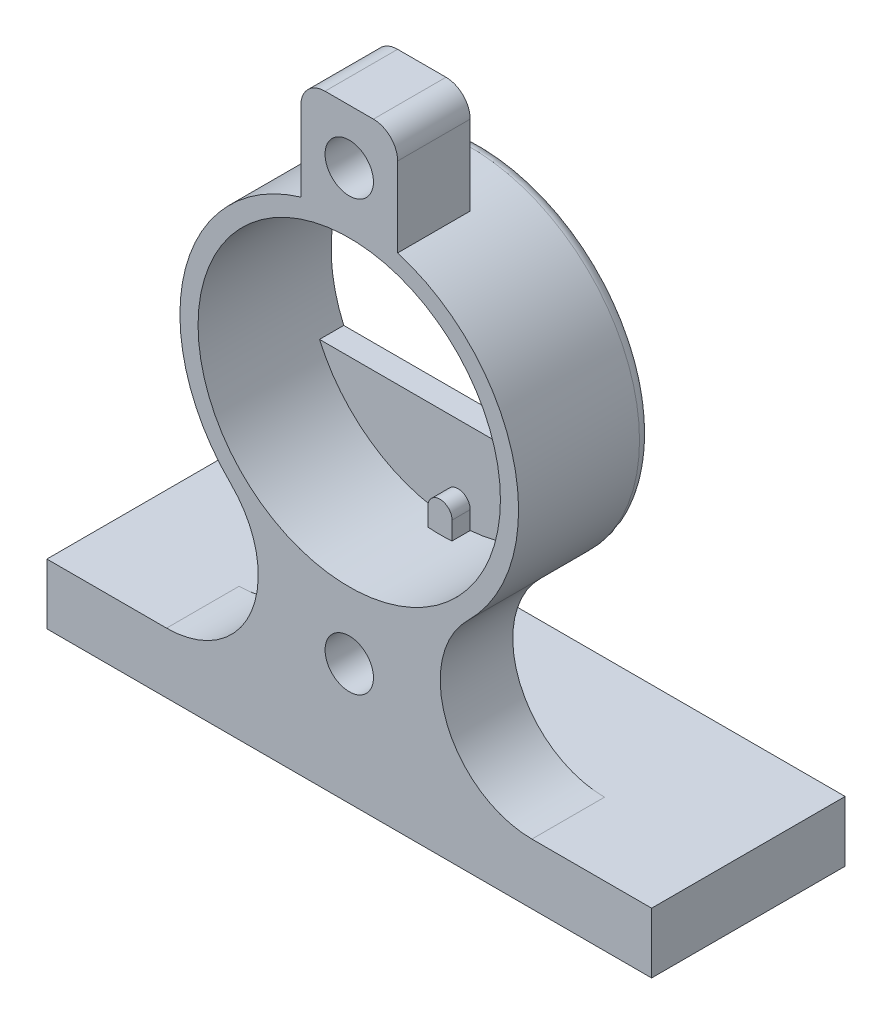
from build123d import *

# Parameters (mm, degrees)
SALIENTE_EXTRUIR1_DEPTH = 11
CROQUIS2_R              = 12.5
CORTAR_EXTRUIR1_DEPTH   = 9
CORTAR_EXTRUIR2_DEPTH   = 39.600518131
CORTAR_EXTRUIR3_DEPTH   = 5
CROQUIS5_R              = 2
CORTAR_EXTRUIR4_DEPTH   = 40.115214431
REDONDEO1_R             = 1
SALIENTE_EXTRUIR2_START = -6
CROQUIS7_R              = 2
SALIENTE_EXTRUIR2_DEPTH = 6
CROQUIS6_R              = 3.25
CORTAR_EXTRUIR5_DEPTH   = 2
SALIENTE_EXTRUIR3_DEPTH = 1.5
CROQUIS9_W              = 50
CROQUIS9_H              = 5
SALIENTE_EXTRUIR4_DEPTH = 10


with BuildPart() as part:
    # Croquis1 → Saliente-Extruir1 (new body)
    with BuildSketch(Plane.XY):
        with BuildLine():
            Line((-25, -28), (25, -28))
            Line((25, -28), (25, -23))
            Line((25, -23), (15.105186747, -23))
            ThreePointArc((15.105186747, -23), (8.084384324, -18.282897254), (9.797958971, -10))
            ThreePointArc((9.797958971, -10), (0, 14), (-9.797958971, -10))
            ThreePointArc((-9.797958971, -10), (-8.084384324, -18.282897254), (-15.105186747, -23))
            Line((-15.105186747, -23), (-25, -23))
            Line((-25, -23), (-25, -28))
        make_face()
    extrude(amount=SALIENTE_EXTRUIR1_DEPTH)

    # Croquis2 → Cortar-Extruir1 (cut)
    with BuildSketch(Plane.XY.offset(11)):
        Circle(CROQUIS2_R)
    extrude(amount=-CORTAR_EXTRUIR1_DEPTH, mode=Mode.SUBTRACT)

    # Croquis3 → Cortar-Extruir2 (cut, through all)
    with BuildSketch(Plane.XY.offset(2)):
        with BuildLine():
            Line((-11.456439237, -5), (11.456439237, -5))
            ThreePointArc((11.456439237, -5), (12.5, 0), (11.456439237, 5))
            Line((11.456439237, 5), (-11.456439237, 5))
            ThreePointArc((-11.456439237, 5), (-12.5, 0), (-11.456439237, -5))
        make_face()
    extrude(amount=-CORTAR_EXTRUIR2_DEPTH, mode=Mode.SUBTRACT)

    # Croquis4 → Cortar-Extruir3 (cut)
    with BuildSketch(Plane(origin=(0, 0, 0), x_dir=(-1, 0, 0), z_dir=(0, 0, -1))):
        with BuildLine():
            Line((-11.821590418, -7.5), (-25, -23))
            Line((-25, -23), (-25, -28))
            Line((-25, -28), (25, -28))
            Line((25, -28), (25, -23))
            Line((25, -23), (11.821590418, -7.5))
            ThreePointArc((11.821590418, -7.5), (0, -14), (-11.821590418, -7.5))
        make_face()
    extrude(amount=-CORTAR_EXTRUIR3_DEPTH, mode=Mode.SUBTRACT)

    # Croquis5 → Cortar-Extruir4 (cut, through all)
    with BuildSketch(Plane.XY.offset(11)):
        with Locations((0, -18)):
            Circle(CROQUIS5_R)
    extrude(amount=-CORTAR_EXTRUIR4_DEPTH, mode=Mode.SUBTRACT)

    # Redondeo1
    redondeo1_edges = [part.edges().sort_by_distance(p)[0] for p in [
        (9.797958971, 10, 0),
    ]]
    fillet(redondeo1_edges, radius=REDONDEO1_R)

    # Croquis7 → Saliente-Extruir2 (add)
    with BuildSketch(Plane.XY.offset(11).offset(SALIENTE_EXTRUIR2_START)):
        with BuildLine():
            Line((-4, 13.416407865), (-4, 20))
            ThreePointArc((-4, 20), (-3.414213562, 21.414213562), (-2, 22))
            Line((-2, 22), (2, 22))
            ThreePointArc((2, 22), (3.414213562, 21.414213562), (4, 20))
            Line((4, 20), (4, 13.416407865))
            ThreePointArc((4, 13.416407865), (0, 14), (-4, 13.416407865))
        make_face()
        with Locations((0, 17.5)):
            Circle(CROQUIS7_R, mode=Mode.SUBTRACT)
    extrude(amount=SALIENTE_EXTRUIR2_DEPTH)

    # Croquis6 → Cortar-Extruir5 (cut)
    with BuildSketch(Plane(origin=(0, 0, 5), x_dir=(-1, 0, 0), z_dir=(0, 0, -1))):
        with Locations((0, -18)):
            Circle(CROQUIS6_R)
        with Locations((0, 17.5)):
            Circle(CROQUIS6_R)
    extrude(amount=-CORTAR_EXTRUIR5_DEPTH, mode=Mode.SUBTRACT)

    # Croquis8 → Saliente-Extruir3 (add)
    with BuildSketch(Plane.XY.offset(2)):
        with BuildLine():
            Line((-1, -13.964240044), (-1, -10.964240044))
            ThreePointArc((-1, -10.964240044), (0, -9.964240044), (1, -10.964240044))
            Line((1, -10.964240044), (1, -13.964240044))
            Line((1, -13.964240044), (-1, -13.964240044))
        make_face()
        with BuildLine():
            Line((-1, 13.964240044), (-1, 10.964240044))
            ThreePointArc((-1, 10.964240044), (0, 9.964240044), (1, 10.964240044))
            Line((1, 10.964240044), (1, 13.964240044))
            Line((1, 13.964240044), (-1, 13.964240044))
        make_face()
    extrude(amount=SALIENTE_EXTRUIR3_DEPTH)

    # Croquis9 → Saliente-Extruir4 (add)
    with BuildSketch(Plane(origin=(0, 0, 5), x_dir=(-1, 0, 0), z_dir=(0, 0, -1))):
        with Locations((0, -25.5)):
            Rectangle(CROQUIS9_W, CROQUIS9_H)
    extrude(amount=SALIENTE_EXTRUIR4_DEPTH)


solid = part.part
